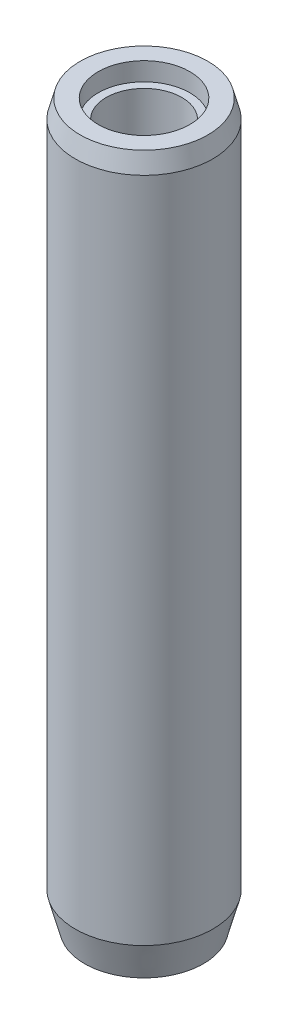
ISO-10303-21;
HEADER;
FILE_DESCRIPTION(('STEP AP214'),'2;1');
FILE_NAME('part.step','',(''),(''),'','','');
FILE_SCHEMA(('AUTOMOTIVE_DESIGN { 1 0 10303 214 1 1 1 1 }'));
ENDSEC;
DATA;
#1=APPLICATION_CONTEXT('core data for automotive mechanical design processes');
#2=APPLICATION_PROTOCOL_DEFINITION('international standard','automotive_design',2000,#1);
#3=PRODUCT_CONTEXT('',#1,'mechanical');
#4=PRODUCT('Part','Part','',(#3));
#5=PRODUCT_RELATED_PRODUCT_CATEGORY('part','',(#4));
#6=PRODUCT_DEFINITION_FORMATION('','',#4);
#7=PRODUCT_DEFINITION_CONTEXT('part definition',#1,'design');
#8=PRODUCT_DEFINITION('design','',#6,#7);
#9=PRODUCT_DEFINITION_SHAPE('','',#8);
#10=(LENGTH_UNIT() NAMED_UNIT(*) SI_UNIT(.MILLI.,.METRE.));
#11=(NAMED_UNIT(*) PLANE_ANGLE_UNIT() SI_UNIT($,.RADIAN.));
#12=(NAMED_UNIT(*) SI_UNIT($,.STERADIAN.) SOLID_ANGLE_UNIT());
#13=UNCERTAINTY_MEASURE_WITH_UNIT(LENGTH_MEASURE(1.E-05),#10,'distance_accuracy_value','');
#14=(GEOMETRIC_REPRESENTATION_CONTEXT(3) GLOBAL_UNCERTAINTY_ASSIGNED_CONTEXT((#13)) GLOBAL_UNIT_ASSIGNED_CONTEXT((#10,
#11,#12)) REPRESENTATION_CONTEXT('',''));
#15=CARTESIAN_POINT('',(0.,0.,0.));
#16=DIRECTION('',(0.,0.,1.));
#17=DIRECTION('',(1.,0.,0.));
#18=AXIS2_PLACEMENT_3D('',#15,#16,#17);
#19=CARTESIAN_POINT('',(0.,6.,0.));
#20=DIRECTION('',(0.,-1.,0.));
#21=DIRECTION('',(-1.,0.,0.));
#22=AXIS2_PLACEMENT_3D('',#19,#20,#21);
#23=SPHERICAL_SURFACE('',#22,6.);
#24=CARTESIAN_POINT('',(0.,0.590443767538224,0.));
#25=DIRECTION('',(0.,-1.,0.));
#26=DIRECTION('',(0.,0.,-1.));
#27=AXIS2_PLACEMENT_3D('',#24,#25,#26);
#28=CIRCLE('',#27,2.59551562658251);
#29=CARTESIAN_POINT('',(0.,0.590443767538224,-2.59551562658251));
#30=VERTEX_POINT('',#29);
#31=EDGE_CURVE('E11',#30,#30,#28,.T.);
#32=ORIENTED_EDGE('',*,*,#31,.T.);
#33=EDGE_LOOP('',(#32));
#34=FACE_BOUND('',#33,.T.);
#35=ADVANCED_FACE('F34',(#34),#23,.T.);
#36=CARTESIAN_POINT('',(0.,0.590443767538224,0.));
#37=DIRECTION('',(0.,1.,0.));
#38=DIRECTION('',(0.,0.,1.));
#39=AXIS2_PLACEMENT_3D('',#36,#37,#38);
#40=CONICAL_SURFACE('',#39,2.59551562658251,0.261799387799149);
#41=CARTESIAN_POINT('',(0.,2.1,0.));
#42=DIRECTION('',(0.,-1.,0.));
#43=DIRECTION('',(0.,0.,-1.));
#44=AXIS2_PLACEMENT_3D('',#41,#42,#43);
#45=CIRCLE('',#44,3.00000000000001);
#46=CARTESIAN_POINT('',(0.,2.1,-3.00000000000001));
#47=VERTEX_POINT('',#46);
#48=EDGE_CURVE('E40',#47,#47,#45,.T.);
#49=ORIENTED_EDGE('',*,*,#48,.T.);
#50=EDGE_LOOP('',(#49));
#51=FACE_BOUND('',#50,.T.);
#52=ORIENTED_EDGE('',*,*,#31,.F.);
#53=EDGE_LOOP('',(#52));
#54=FACE_BOUND('',#53,.T.);
#55=ADVANCED_FACE('F71',(#51,#54),#40,.T.);
#56=CARTESIAN_POINT('',(0.,0.,0.));
#57=DIRECTION('',(0.,-1.,0.));
#58=DIRECTION('',(0.,0.,-1.));
#59=AXIS2_PLACEMENT_3D('',#56,#57,#58);
#60=CYLINDRICAL_SURFACE('',#59,3.);
#61=CARTESIAN_POINT('',(0.,31.2,0.));
#62=DIRECTION('',(0.,-1.,0.));
#63=DIRECTION('',(0.,0.,-1.));
#64=AXIS2_PLACEMENT_3D('',#61,#62,#63);
#65=CIRCLE('',#64,3.);
#66=CARTESIAN_POINT('',(0.,31.2,-3.));
#67=VERTEX_POINT('',#66);
#68=EDGE_CURVE('E66',#67,#67,#65,.T.);
#69=ORIENTED_EDGE('',*,*,#68,.T.);
#70=EDGE_LOOP('',(#69));
#71=FACE_BOUND('',#70,.T.);
#72=ORIENTED_EDGE('',*,*,#48,.F.);
#73=EDGE_LOOP('',(#72));
#74=FACE_BOUND('',#73,.T.);
#75=ADVANCED_FACE('F74',(#71,#74),#60,.T.);
#76=CARTESIAN_POINT('',(0.,31.2,0.));
#77=DIRECTION('',(0.,-1.,0.));
#78=DIRECTION('',(0.,0.,-1.));
#79=AXIS2_PLACEMENT_3D('',#76,#77,#78);
#80=CONICAL_SURFACE('',#79,3.,0.26179938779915);
#81=CARTESIAN_POINT('',(0.,32.,0.));
#82=DIRECTION('',(0.,-1.,0.));
#83=DIRECTION('',(0.,0.,-1.));
#84=AXIS2_PLACEMENT_3D('',#81,#82,#83);
#85=CIRCLE('',#84,2.7856406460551);
#86=CARTESIAN_POINT('',(0.,32.,-2.7856406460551));
#87=VERTEX_POINT('',#86);
#88=EDGE_CURVE('E63',#87,#87,#85,.T.);
#89=ORIENTED_EDGE('',*,*,#88,.T.);
#90=EDGE_LOOP('',(#89));
#91=FACE_BOUND('',#90,.T.);
#92=ORIENTED_EDGE('',*,*,#68,.F.);
#93=EDGE_LOOP('',(#92));
#94=FACE_BOUND('',#93,.T.);
#95=ADVANCED_FACE('F76',(#91,#94),#80,.T.);
#96=CARTESIAN_POINT('',(2.,32.,0.));
#97=DIRECTION('',(0.,1.,0.));
#98=DIRECTION('',(0.,0.,1.));
#99=AXIS2_PLACEMENT_3D('',#96,#97,#98);
#100=PLANE('',#99);
#101=CARTESIAN_POINT('',(0.,32.,0.));
#102=DIRECTION('',(0.,-1.,0.));
#103=DIRECTION('',(0.,0.,-1.));
#104=AXIS2_PLACEMENT_3D('',#101,#102,#103);
#105=CIRCLE('',#104,2.);
#106=CARTESIAN_POINT('',(0.,32.,-2.));
#107=VERTEX_POINT('',#106);
#108=EDGE_CURVE('E60',#107,#107,#105,.T.);
#109=ORIENTED_EDGE('',*,*,#108,.T.);
#110=EDGE_LOOP('',(#109));
#111=FACE_BOUND('',#110,.T.);
#112=ORIENTED_EDGE('',*,*,#88,.F.);
#113=EDGE_LOOP('',(#112));
#114=FACE_BOUND('',#113,.T.);
#115=ADVANCED_FACE('F83',(#111,#114),#100,.T.);
#116=CARTESIAN_POINT('',(0.,0.,0.));
#117=DIRECTION('',(0.,-1.,0.));
#118=DIRECTION('',(0.,0.,-1.));
#119=AXIS2_PLACEMENT_3D('',#116,#117,#118);
#120=CYLINDRICAL_SURFACE('',#119,2.);
#121=CARTESIAN_POINT('',(0.,31.2,0.));
#122=DIRECTION('',(0.,-1.,0.));
#123=DIRECTION('',(0.,0.,-1.));
#124=AXIS2_PLACEMENT_3D('',#121,#122,#123);
#125=CIRCLE('',#124,2.);
#126=CARTESIAN_POINT('',(0.,31.2,-2.));
#127=VERTEX_POINT('',#126);
#128=EDGE_CURVE('E55',#127,#127,#125,.T.);
#129=ORIENTED_EDGE('',*,*,#128,.T.);
#130=EDGE_LOOP('',(#129));
#131=FACE_BOUND('',#130,.T.);
#132=ORIENTED_EDGE('',*,*,#108,.F.);
#133=EDGE_LOOP('',(#132));
#134=FACE_BOUND('',#133,.T.);
#135=ADVANCED_FACE('F114',(#131,#134),#120,.F.);
#136=CARTESIAN_POINT('',(2.,31.2,0.));
#137=DIRECTION('',(0.,1.,0.));
#138=DIRECTION('',(0.,0.,1.));
#139=AXIS2_PLACEMENT_3D('',#136,#137,#138);
#140=PLANE('',#139);
#141=CARTESIAN_POINT('',(0.,31.2,0.));
#142=DIRECTION('',(0.,-1.,0.));
#143=DIRECTION('',(0.,0.,-1.));
#144=AXIS2_PLACEMENT_3D('',#141,#142,#143);
#145=CIRCLE('',#144,1.65);
#146=CARTESIAN_POINT('',(0.,31.2,-1.65));
#147=VERTEX_POINT('',#146);
#148=EDGE_CURVE('E52',#147,#147,#145,.T.);
#149=ORIENTED_EDGE('',*,*,#148,.T.);
#150=EDGE_LOOP('',(#149));
#151=FACE_BOUND('',#150,.T.);
#152=ORIENTED_EDGE('',*,*,#128,.F.);
#153=EDGE_LOOP('',(#152));
#154=FACE_BOUND('',#153,.T.);
#155=ADVANCED_FACE('F124',(#151,#154),#140,.T.);
#156=CARTESIAN_POINT('',(0.,0.,0.));
#157=DIRECTION('',(0.,-1.,0.));
#158=DIRECTION('',(0.,0.,-1.));
#159=AXIS2_PLACEMENT_3D('',#156,#157,#158);
#160=CYLINDRICAL_SURFACE('',#159,1.65);
#161=CARTESIAN_POINT('',(0.,21.5,0.));
#162=DIRECTION('',(0.,-1.,0.));
#163=DIRECTION('',(0.,0.,-1.));
#164=AXIS2_PLACEMENT_3D('',#161,#162,#163);
#165=CIRCLE('',#164,1.65);
#166=CARTESIAN_POINT('',(0.,21.5,-1.65));
#167=VERTEX_POINT('',#166);
#168=EDGE_CURVE('E50',#167,#167,#165,.T.);
#169=ORIENTED_EDGE('',*,*,#168,.T.);
#170=EDGE_LOOP('',(#169));
#171=FACE_BOUND('',#170,.T.);
#172=ORIENTED_EDGE('',*,*,#148,.F.);
#173=EDGE_LOOP('',(#172));
#174=FACE_BOUND('',#173,.T.);
#175=ADVANCED_FACE('F46',(#171,#174),#160,.F.);
#176=CARTESIAN_POINT('',(0.,21.5,0.));
#177=DIRECTION('',(0.,1.,0.));
#178=DIRECTION('',(0.,0.,1.));
#179=AXIS2_PLACEMENT_3D('',#176,#177,#178);
#180=CONICAL_SURFACE('',#179,1.65,1.02974425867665);
#181=CARTESIAN_POINT('',(0.,20.5085799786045,0.));
#182=VERTEX_POINT('',#181);
#183=VERTEX_LOOP('',#182);
#184=FACE_BOUND('',#183,.T.);
#185=ORIENTED_EDGE('',*,*,#168,.F.);
#186=EDGE_LOOP('',(#185));
#187=FACE_BOUND('',#186,.T.);
#188=ADVANCED_FACE('F43',(#184,#187),#180,.F.);
#189=CLOSED_SHELL('',(#35,#55,#75,#95,#115,#135,#155,#175,#188));
#190=MANIFOLD_SOLID_BREP('B2',#189);
#191=ADVANCED_BREP_SHAPE_REPRESENTATION('',(#18,#190),#14);
#192=SHAPE_DEFINITION_REPRESENTATION(#9,#191);
ENDSEC;
END-ISO-10303-21;
